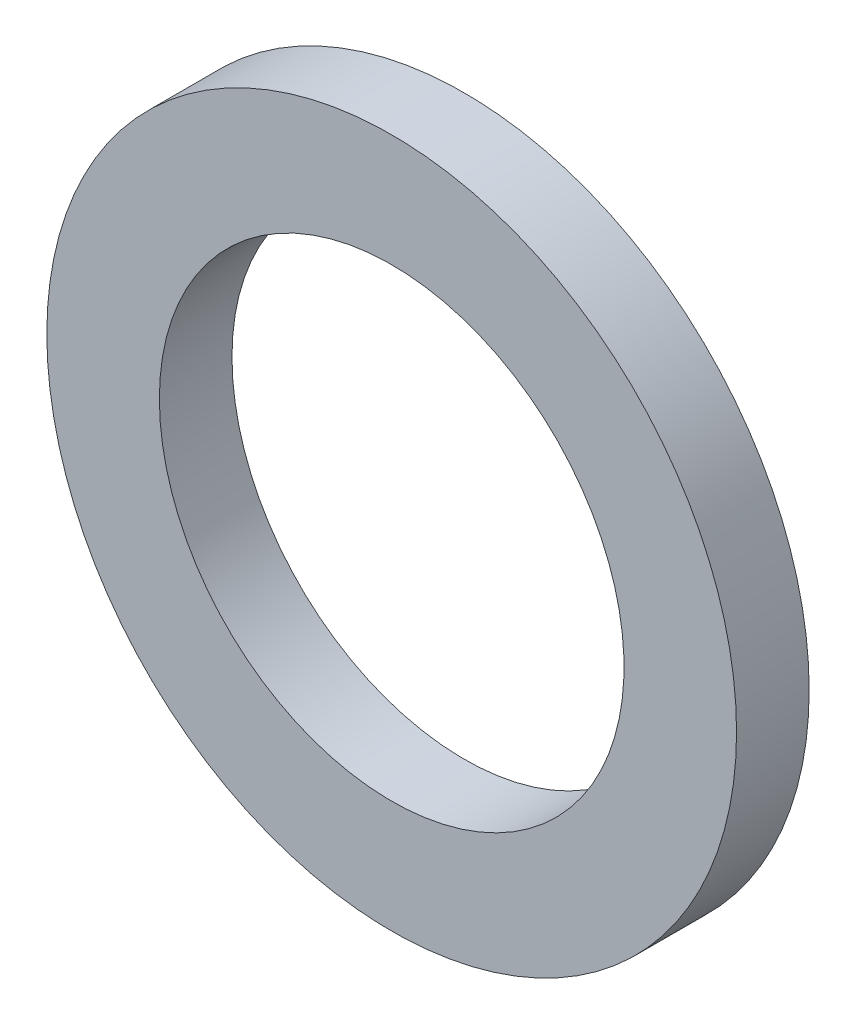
ISO-10303-21;
HEADER;
FILE_DESCRIPTION(('STEP AP214'),'2;1');
FILE_NAME('part.step','',(''),(''),'','','');
FILE_SCHEMA(('AUTOMOTIVE_DESIGN { 1 0 10303 214 1 1 1 1 }'));
ENDSEC;
DATA;
#1=APPLICATION_CONTEXT('core data for automotive mechanical design processes');
#2=APPLICATION_PROTOCOL_DEFINITION('international standard','automotive_design',2000,#1);
#3=PRODUCT_CONTEXT('',#1,'mechanical');
#4=PRODUCT('Part','Part','',(#3));
#5=PRODUCT_RELATED_PRODUCT_CATEGORY('part','',(#4));
#6=PRODUCT_DEFINITION_FORMATION('','',#4);
#7=PRODUCT_DEFINITION_CONTEXT('part definition',#1,'design');
#8=PRODUCT_DEFINITION('design','',#6,#7);
#9=PRODUCT_DEFINITION_SHAPE('','',#8);
#10=(LENGTH_UNIT() NAMED_UNIT(*) SI_UNIT(.MILLI.,.METRE.));
#11=(NAMED_UNIT(*) PLANE_ANGLE_UNIT() SI_UNIT($,.RADIAN.));
#12=(NAMED_UNIT(*) SI_UNIT($,.STERADIAN.) SOLID_ANGLE_UNIT());
#13=UNCERTAINTY_MEASURE_WITH_UNIT(LENGTH_MEASURE(1.E-05),#10,'distance_accuracy_value','');
#14=(GEOMETRIC_REPRESENTATION_CONTEXT(3) GLOBAL_UNCERTAINTY_ASSIGNED_CONTEXT((#13)) GLOBAL_UNIT_ASSIGNED_CONTEXT((#10,
#11,#12)) REPRESENTATION_CONTEXT('',''));
#15=CARTESIAN_POINT('',(0.,0.,0.));
#16=DIRECTION('',(0.,0.,1.));
#17=DIRECTION('',(1.,0.,0.));
#18=AXIS2_PLACEMENT_3D('',#15,#16,#17);
#19=CARTESIAN_POINT('',(-59.10260396,256.225433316,-16.));
#20=DIRECTION('',(0.,0.,-0.999999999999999));
#21=DIRECTION('',(-1.,0.,0.));
#22=AXIS2_PLACEMENT_3D('',#19,#20,#21);
#23=CYLINDRICAL_SURFACE('',#22,4.75000000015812);
#24=CARTESIAN_POINT('',(-59.10260396,256.225433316,-16.));
#25=DIRECTION('',(0.,0.,-0.999999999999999));
#26=DIRECTION('',(-1.,0.,0.));
#27=AXIS2_PLACEMENT_3D('',#24,#25,#26);
#28=CIRCLE('',#27,4.75000000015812);
#29=CARTESIAN_POINT('',(-63.8526039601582,256.225433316,-16.));
#30=VERTEX_POINT('',#29);
#31=EDGE_CURVE('E19',#30,#30,#28,.F.);
#32=CARTESIAN_POINT('',(-59.10260396,256.225433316,-17.));
#33=DIRECTION('',(0.,0.,-0.999999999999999));
#34=DIRECTION('',(-1.,0.,0.));
#35=AXIS2_PLACEMENT_3D('',#32,#33,#34);
#36=CIRCLE('',#35,4.75000000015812);
#37=CARTESIAN_POINT('',(-63.8526039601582,256.225433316,-17.));
#38=VERTEX_POINT('',#37);
#39=EDGE_CURVE('E32',#38,#38,#36,.F.);
#40=CARTESIAN_POINT('',(-63.8526039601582,256.225433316,-16.));
#41=CARTESIAN_POINT('',(-63.8526039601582,256.225433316,-16.0104166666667));
#42=CARTESIAN_POINT('',(-63.8526039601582,256.225433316,-16.0208333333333));
#43=CARTESIAN_POINT('',(-63.8526039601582,256.225433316,-16.0416666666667));
#44=CARTESIAN_POINT('',(-63.8526039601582,256.225433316,-16.0520833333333));
#45=CARTESIAN_POINT('',(-63.8526039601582,256.225433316,-16.0729166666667));
#46=CARTESIAN_POINT('',(-63.8526039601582,256.225433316,-16.0833333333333));
#47=CARTESIAN_POINT('',(-63.8526039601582,256.225433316,-16.1041666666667));
#48=CARTESIAN_POINT('',(-63.8526039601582,256.225433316,-16.1145833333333));
#49=CARTESIAN_POINT('',(-63.8526039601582,256.225433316,-16.1354166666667));
#50=CARTESIAN_POINT('',(-63.8526039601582,256.225433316,-16.1458333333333));
#51=CARTESIAN_POINT('',(-63.8526039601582,256.225433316,-16.1666666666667));
#52=CARTESIAN_POINT('',(-63.8526039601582,256.225433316,-16.1770833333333));
#53=CARTESIAN_POINT('',(-63.8526039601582,256.225433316,-16.1979166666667));
#54=CARTESIAN_POINT('',(-63.8526039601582,256.225433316,-16.2083333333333));
#55=CARTESIAN_POINT('',(-63.8526039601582,256.225433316,-16.2291666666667));
#56=CARTESIAN_POINT('',(-63.8526039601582,256.225433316,-16.2395833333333));
#57=CARTESIAN_POINT('',(-63.8526039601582,256.225433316,-16.2604166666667));
#58=CARTESIAN_POINT('',(-63.8526039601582,256.225433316,-16.2708333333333));
#59=CARTESIAN_POINT('',(-63.8526039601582,256.225433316,-16.2916666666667));
#60=CARTESIAN_POINT('',(-63.8526039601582,256.225433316,-16.3020833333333));
#61=CARTESIAN_POINT('',(-63.8526039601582,256.225433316,-16.3229166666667));
#62=CARTESIAN_POINT('',(-63.8526039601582,256.225433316,-16.3333333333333));
#63=CARTESIAN_POINT('',(-63.8526039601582,256.225433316,-16.3541666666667));
#64=CARTESIAN_POINT('',(-63.8526039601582,256.225433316,-16.3645833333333));
#65=CARTESIAN_POINT('',(-63.8526039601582,256.225433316,-16.3854166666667));
#66=CARTESIAN_POINT('',(-63.8526039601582,256.225433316,-16.3958333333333));
#67=CARTESIAN_POINT('',(-63.8526039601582,256.225433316,-16.4166666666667));
#68=CARTESIAN_POINT('',(-63.8526039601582,256.225433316,-16.4270833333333));
#69=CARTESIAN_POINT('',(-63.8526039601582,256.225433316,-16.4479166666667));
#70=CARTESIAN_POINT('',(-63.8526039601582,256.225433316,-16.4583333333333));
#71=CARTESIAN_POINT('',(-63.8526039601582,256.225433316,-16.4791666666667));
#72=CARTESIAN_POINT('',(-63.8526039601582,256.225433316,-16.4895833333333));
#73=CARTESIAN_POINT('',(-63.8526039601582,256.225433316,-16.5104166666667));
#74=CARTESIAN_POINT('',(-63.8526039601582,256.225433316,-16.5208333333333));
#75=CARTESIAN_POINT('',(-63.8526039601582,256.225433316,-16.5416666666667));
#76=CARTESIAN_POINT('',(-63.8526039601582,256.225433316,-16.5520833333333));
#77=CARTESIAN_POINT('',(-63.8526039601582,256.225433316,-16.5729166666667));
#78=CARTESIAN_POINT('',(-63.8526039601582,256.225433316,-16.5833333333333));
#79=CARTESIAN_POINT('',(-63.8526039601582,256.225433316,-16.6041666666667));
#80=CARTESIAN_POINT('',(-63.8526039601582,256.225433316,-16.6145833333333));
#81=CARTESIAN_POINT('',(-63.8526039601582,256.225433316,-16.6354166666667));
#82=CARTESIAN_POINT('',(-63.8526039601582,256.225433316,-16.6458333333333));
#83=CARTESIAN_POINT('',(-63.8526039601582,256.225433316,-16.6666666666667));
#84=CARTESIAN_POINT('',(-63.8526039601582,256.225433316,-16.6770833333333));
#85=CARTESIAN_POINT('',(-63.8526039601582,256.225433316,-16.6979166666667));
#86=CARTESIAN_POINT('',(-63.8526039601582,256.225433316,-16.7083333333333));
#87=CARTESIAN_POINT('',(-63.8526039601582,256.225433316,-16.7291666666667));
#88=CARTESIAN_POINT('',(-63.8526039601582,256.225433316,-16.7395833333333));
#89=CARTESIAN_POINT('',(-63.8526039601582,256.225433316,-16.7604166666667));
#90=CARTESIAN_POINT('',(-63.8526039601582,256.225433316,-16.7708333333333));
#91=CARTESIAN_POINT('',(-63.8526039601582,256.225433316,-16.7916666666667));
#92=CARTESIAN_POINT('',(-63.8526039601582,256.225433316,-16.8020833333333));
#93=CARTESIAN_POINT('',(-63.8526039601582,256.225433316,-16.8229166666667));
#94=CARTESIAN_POINT('',(-63.8526039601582,256.225433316,-16.8333333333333));
#95=CARTESIAN_POINT('',(-63.8526039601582,256.225433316,-16.8541666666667));
#96=CARTESIAN_POINT('',(-63.8526039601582,256.225433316,-16.8645833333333));
#97=CARTESIAN_POINT('',(-63.8526039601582,256.225433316,-16.8854166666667));
#98=CARTESIAN_POINT('',(-63.8526039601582,256.225433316,-16.8958333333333));
#99=CARTESIAN_POINT('',(-63.8526039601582,256.225433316,-16.9166666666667));
#100=CARTESIAN_POINT('',(-63.8526039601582,256.225433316,-16.9270833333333));
#101=CARTESIAN_POINT('',(-63.8526039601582,256.225433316,-16.9479166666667));
#102=CARTESIAN_POINT('',(-63.8526039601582,256.225433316,-16.9583333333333));
#103=CARTESIAN_POINT('',(-63.8526039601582,256.225433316,-16.9791666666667));
#104=CARTESIAN_POINT('',(-63.8526039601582,256.225433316,-16.9895833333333));
#105=CARTESIAN_POINT('',(-63.8526039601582,256.225433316,-17.));
#106=B_SPLINE_CURVE_WITH_KNOTS('',3,(#40,#41,#42,#43,#44,#45,#46,#47,#48,#49,#50,#51,#52,#53,
#54,#55,#56,#57,#58,#59,#60,#61,#62,#63,#64,#65,#66,#67,#68,#69,#70,#71,#72,#73,#74,#75,#76,#77,
#78,#79,#80,#81,#82,#83,#84,#85,#86,#87,#88,#89,#90,#91,#92,#93,#94,#95,#96,#97,#98,#99,#100,
#101,#102,#103,#104,#105),.UNSPECIFIED.,.F.,.F.,(4,2,2,2,2,2,2,2,2,2,2,2,2,2,2,2,2,2,2,2,2,2,2,
2,2,2,2,2,2,2,2,2,4),(0.,0.03125,0.0625000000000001,0.0937500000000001,0.125,0.15625,0.1875,
0.21875,0.25,0.28125,0.3125,0.34375,0.375,0.40625,0.4375,0.46875,0.5,0.53125,0.5625,
0.593750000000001,0.625000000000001,0.656250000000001,0.687500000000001,0.718750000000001,
0.750000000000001,0.781250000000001,0.812500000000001,0.843750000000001,0.875000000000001,
0.906250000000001,0.937500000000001,0.968750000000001,1.),.UNSPECIFIED.);
#107=EDGE_CURVE('BSEAM15',#30,#38,#106,.T.);
#108=ORIENTED_EDGE('',*,*,#31,.F.);
#109=ORIENTED_EDGE('',*,*,#39,.T.);
#110=ORIENTED_EDGE('',*,*,#107,.T.);
#111=ORIENTED_EDGE('',*,*,#107,.F.);
#112=EDGE_LOOP('',(#108,#110,#109,#111));
#113=FACE_BOUND('',#112,.T.);
#114=ADVANCED_FACE('F15',(#113),#23,.T.);
#115=CARTESIAN_POINT('',(-65.415715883,253.703704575,-16.));
#116=DIRECTION('',(0.,0.,0.999999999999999));
#117=DIRECTION('',(0.91895575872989,-0.394360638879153,0.));
#118=AXIS2_PLACEMENT_3D('',#115,#116,#117);
#119=PLANE('',#118);
#120=CARTESIAN_POINT('',(-59.10260396,256.225433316,-16.));
#121=DIRECTION('',(0.,0.,-0.999999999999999));
#122=DIRECTION('',(-1.,0.,0.));
#123=AXIS2_PLACEMENT_3D('',#120,#121,#122);
#124=CIRCLE('',#123,3.19999999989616);
#125=CARTESIAN_POINT('',(-62.3026039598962,256.225433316,-16.));
#126=VERTEX_POINT('',#125);
#127=EDGE_CURVE('E24',#126,#126,#124,.F.);
#128=ORIENTED_EDGE('',*,*,#127,.F.);
#129=EDGE_LOOP('',(#128));
#130=FACE_BOUND('',#129,.T.);
#131=ORIENTED_EDGE('',*,*,#31,.T.);
#132=EDGE_LOOP('',(#131));
#133=FACE_BOUND('',#132,.T.);
#134=ADVANCED_FACE('F41',(#130,#133),#119,.T.);
#135=CARTESIAN_POINT('',(-65.415715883,253.703704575,-17.));
#136=DIRECTION('',(0.,0.,0.999999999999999));
#137=DIRECTION('',(0.91895575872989,-0.394360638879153,0.));
#138=AXIS2_PLACEMENT_3D('',#135,#136,#137);
#139=PLANE('',#138);
#140=CARTESIAN_POINT('',(-59.10260396,256.225433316,-17.));
#141=DIRECTION('',(0.,0.,-0.999999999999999));
#142=DIRECTION('',(-1.,0.,0.));
#143=AXIS2_PLACEMENT_3D('',#140,#141,#142);
#144=CIRCLE('',#143,3.19999999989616);
#145=CARTESIAN_POINT('',(-62.3026039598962,256.225433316,-17.));
#146=VERTEX_POINT('',#145);
#147=EDGE_CURVE('E10',#146,#146,#144,.T.);
#148=ORIENTED_EDGE('',*,*,#147,.F.);
#149=EDGE_LOOP('',(#148));
#150=FACE_BOUND('',#149,.T.);
#151=ORIENTED_EDGE('',*,*,#39,.F.);
#152=EDGE_LOOP('',(#151));
#153=FACE_BOUND('',#152,.T.);
#154=ADVANCED_FACE('F17',(#150,#153),#139,.F.);
#155=CARTESIAN_POINT('',(-59.10260396,256.225433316,-16.));
#156=DIRECTION('',(0.,0.,-0.999999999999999));
#157=DIRECTION('',(-1.,0.,0.));
#158=AXIS2_PLACEMENT_3D('',#155,#156,#157);
#159=CYLINDRICAL_SURFACE('',#158,3.19999999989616);
#160=CARTESIAN_POINT('',(-62.3026039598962,256.225433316,-16.));
#161=CARTESIAN_POINT('',(-62.3026039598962,256.225433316,-16.0104166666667));
#162=CARTESIAN_POINT('',(-62.3026039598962,256.225433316,-16.0208333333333));
#163=CARTESIAN_POINT('',(-62.3026039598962,256.225433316,-16.0416666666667));
#164=CARTESIAN_POINT('',(-62.3026039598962,256.225433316,-16.0520833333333));
#165=CARTESIAN_POINT('',(-62.3026039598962,256.225433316,-16.0729166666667));
#166=CARTESIAN_POINT('',(-62.3026039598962,256.225433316,-16.0833333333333));
#167=CARTESIAN_POINT('',(-62.3026039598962,256.225433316,-16.1041666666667));
#168=CARTESIAN_POINT('',(-62.3026039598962,256.225433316,-16.1145833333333));
#169=CARTESIAN_POINT('',(-62.3026039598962,256.225433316,-16.1354166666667));
#170=CARTESIAN_POINT('',(-62.3026039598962,256.225433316,-16.1458333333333));
#171=CARTESIAN_POINT('',(-62.3026039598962,256.225433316,-16.1666666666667));
#172=CARTESIAN_POINT('',(-62.3026039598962,256.225433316,-16.1770833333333));
#173=CARTESIAN_POINT('',(-62.3026039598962,256.225433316,-16.1979166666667));
#174=CARTESIAN_POINT('',(-62.3026039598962,256.225433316,-16.2083333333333));
#175=CARTESIAN_POINT('',(-62.3026039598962,256.225433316,-16.2291666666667));
#176=CARTESIAN_POINT('',(-62.3026039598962,256.225433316,-16.2395833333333));
#177=CARTESIAN_POINT('',(-62.3026039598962,256.225433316,-16.2604166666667));
#178=CARTESIAN_POINT('',(-62.3026039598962,256.225433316,-16.2708333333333));
#179=CARTESIAN_POINT('',(-62.3026039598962,256.225433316,-16.2916666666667));
#180=CARTESIAN_POINT('',(-62.3026039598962,256.225433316,-16.3020833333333));
#181=CARTESIAN_POINT('',(-62.3026039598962,256.225433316,-16.3229166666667));
#182=CARTESIAN_POINT('',(-62.3026039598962,256.225433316,-16.3333333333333));
#183=CARTESIAN_POINT('',(-62.3026039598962,256.225433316,-16.3541666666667));
#184=CARTESIAN_POINT('',(-62.3026039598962,256.225433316,-16.3645833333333));
#185=CARTESIAN_POINT('',(-62.3026039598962,256.225433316,-16.3854166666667));
#186=CARTESIAN_POINT('',(-62.3026039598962,256.225433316,-16.3958333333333));
#187=CARTESIAN_POINT('',(-62.3026039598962,256.225433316,-16.4166666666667));
#188=CARTESIAN_POINT('',(-62.3026039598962,256.225433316,-16.4270833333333));
#189=CARTESIAN_POINT('',(-62.3026039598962,256.225433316,-16.4479166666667));
#190=CARTESIAN_POINT('',(-62.3026039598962,256.225433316,-16.4583333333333));
#191=CARTESIAN_POINT('',(-62.3026039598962,256.225433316,-16.4791666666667));
#192=CARTESIAN_POINT('',(-62.3026039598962,256.225433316,-16.4895833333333));
#193=CARTESIAN_POINT('',(-62.3026039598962,256.225433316,-16.5104166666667));
#194=CARTESIAN_POINT('',(-62.3026039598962,256.225433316,-16.5208333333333));
#195=CARTESIAN_POINT('',(-62.3026039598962,256.225433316,-16.5416666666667));
#196=CARTESIAN_POINT('',(-62.3026039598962,256.225433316,-16.5520833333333));
#197=CARTESIAN_POINT('',(-62.3026039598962,256.225433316,-16.5729166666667));
#198=CARTESIAN_POINT('',(-62.3026039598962,256.225433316,-16.5833333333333));
#199=CARTESIAN_POINT('',(-62.3026039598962,256.225433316,-16.6041666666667));
#200=CARTESIAN_POINT('',(-62.3026039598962,256.225433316,-16.6145833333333));
#201=CARTESIAN_POINT('',(-62.3026039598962,256.225433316,-16.6354166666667));
#202=CARTESIAN_POINT('',(-62.3026039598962,256.225433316,-16.6458333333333));
#203=CARTESIAN_POINT('',(-62.3026039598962,256.225433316,-16.6666666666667));
#204=CARTESIAN_POINT('',(-62.3026039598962,256.225433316,-16.6770833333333));
#205=CARTESIAN_POINT('',(-62.3026039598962,256.225433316,-16.6979166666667));
#206=CARTESIAN_POINT('',(-62.3026039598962,256.225433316,-16.7083333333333));
#207=CARTESIAN_POINT('',(-62.3026039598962,256.225433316,-16.7291666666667));
#208=CARTESIAN_POINT('',(-62.3026039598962,256.225433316,-16.7395833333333));
#209=CARTESIAN_POINT('',(-62.3026039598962,256.225433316,-16.7604166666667));
#210=CARTESIAN_POINT('',(-62.3026039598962,256.225433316,-16.7708333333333));
#211=CARTESIAN_POINT('',(-62.3026039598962,256.225433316,-16.7916666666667));
#212=CARTESIAN_POINT('',(-62.3026039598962,256.225433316,-16.8020833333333));
#213=CARTESIAN_POINT('',(-62.3026039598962,256.225433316,-16.8229166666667));
#214=CARTESIAN_POINT('',(-62.3026039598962,256.225433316,-16.8333333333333));
#215=CARTESIAN_POINT('',(-62.3026039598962,256.225433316,-16.8541666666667));
#216=CARTESIAN_POINT('',(-62.3026039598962,256.225433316,-16.8645833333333));
#217=CARTESIAN_POINT('',(-62.3026039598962,256.225433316,-16.8854166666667));
#218=CARTESIAN_POINT('',(-62.3026039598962,256.225433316,-16.8958333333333));
#219=CARTESIAN_POINT('',(-62.3026039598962,256.225433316,-16.9166666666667));
#220=CARTESIAN_POINT('',(-62.3026039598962,256.225433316,-16.9270833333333));
#221=CARTESIAN_POINT('',(-62.3026039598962,256.225433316,-16.9479166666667));
#222=CARTESIAN_POINT('',(-62.3026039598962,256.225433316,-16.9583333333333));
#223=CARTESIAN_POINT('',(-62.3026039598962,256.225433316,-16.9791666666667));
#224=CARTESIAN_POINT('',(-62.3026039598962,256.225433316,-16.9895833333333));
#225=CARTESIAN_POINT('',(-62.3026039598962,256.225433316,-17.));
#226=B_SPLINE_CURVE_WITH_KNOTS('',3,(#160,#161,#162,#163,#164,#165,#166,#167,#168,#169,#170,
#171,#172,#173,#174,#175,#176,#177,#178,#179,#180,#181,#182,#183,#184,#185,#186,#187,#188,#189,
#190,#191,#192,#193,#194,#195,#196,#197,#198,#199,#200,#201,#202,#203,#204,#205,#206,#207,#208,
#209,#210,#211,#212,#213,#214,#215,#216,#217,#218,#219,#220,#221,#222,#223,#224,#225),
.UNSPECIFIED.,.F.,.F.,(4,2,2,2,2,2,2,2,2,2,2,2,2,2,2,2,2,2,2,2,2,2,2,2,2,2,2,2,2,2,2,2,4),(0.,
0.0312500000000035,0.0625000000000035,0.0937500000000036,0.125000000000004,0.156250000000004,
0.187500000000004,0.218750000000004,0.250000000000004,0.281250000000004,0.312500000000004,
0.343750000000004,0.375000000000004,0.406250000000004,0.437500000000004,0.468750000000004,
0.500000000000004,0.531250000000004,0.562500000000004,0.593750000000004,0.625000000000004,
0.656250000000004,0.687500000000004,0.718750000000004,0.750000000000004,0.781250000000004,
0.812500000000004,0.843750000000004,0.875000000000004,0.906250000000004,0.937500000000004,
0.968750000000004,1.),.UNSPECIFIED.);
#227=EDGE_CURVE('BSEAM51',#126,#146,#226,.T.);
#228=ORIENTED_EDGE('',*,*,#127,.T.);
#229=ORIENTED_EDGE('',*,*,#147,.T.);
#230=ORIENTED_EDGE('',*,*,#227,.T.);
#231=ORIENTED_EDGE('',*,*,#227,.F.);
#232=EDGE_LOOP('',(#228,#230,#229,#231));
#233=FACE_BOUND('',#232,.T.);
#234=ADVANCED_FACE('F51',(#233),#159,.F.);
#235=CLOSED_SHELL('',(#114,#134,#154,#234));
#236=MANIFOLD_SOLID_BREP('B1',#235);
#237=ADVANCED_BREP_SHAPE_REPRESENTATION('',(#18,#236),#14);
#238=SHAPE_DEFINITION_REPRESENTATION(#9,#237);
ENDSEC;
END-ISO-10303-21;
